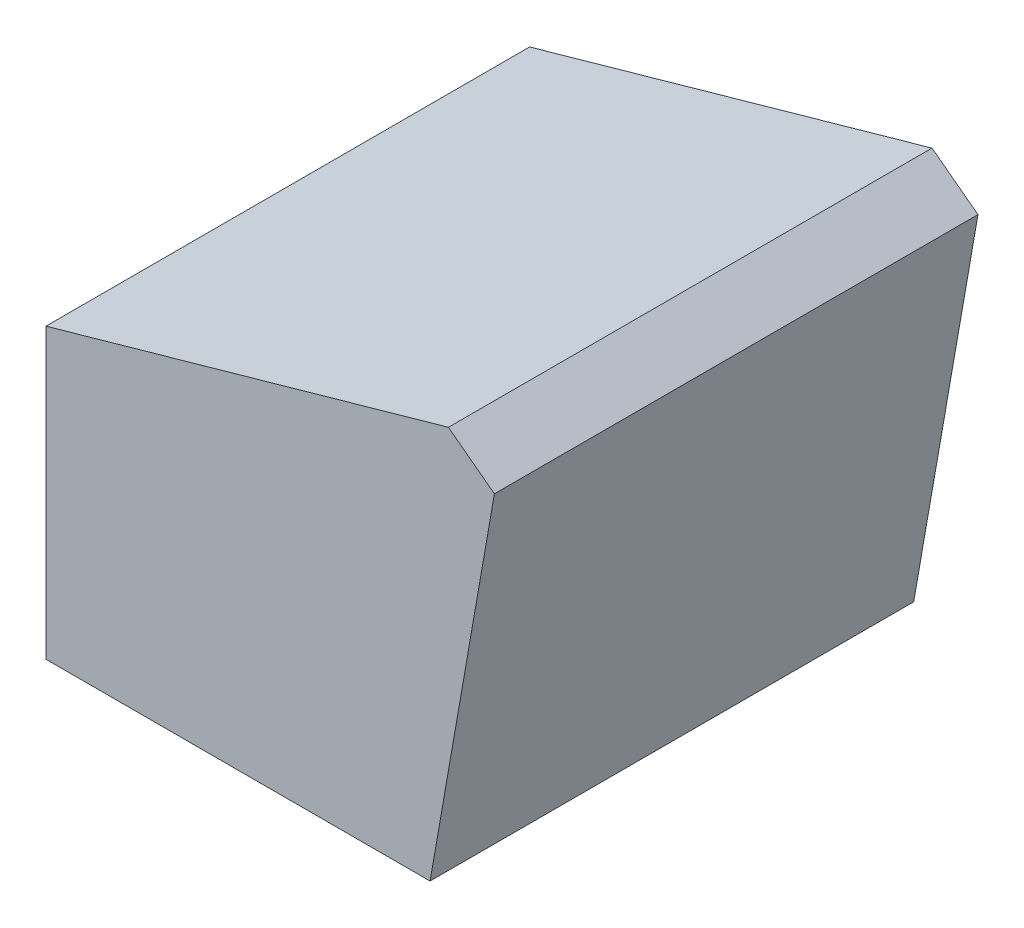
ISO-10303-21;
HEADER;
FILE_DESCRIPTION(('STEP AP214'),'2;1');
FILE_NAME('part.step','',(''),(''),'','','');
FILE_SCHEMA(('AUTOMOTIVE_DESIGN { 1 0 10303 214 1 1 1 1 }'));
ENDSEC;
DATA;
#1=APPLICATION_CONTEXT('core data for automotive mechanical design processes');
#2=APPLICATION_PROTOCOL_DEFINITION('international standard','automotive_design',2000,#1);
#3=PRODUCT_CONTEXT('',#1,'mechanical');
#4=PRODUCT('Part','Part','',(#3));
#5=PRODUCT_RELATED_PRODUCT_CATEGORY('part','',(#4));
#6=PRODUCT_DEFINITION_FORMATION('','',#4);
#7=PRODUCT_DEFINITION_CONTEXT('part definition',#1,'design');
#8=PRODUCT_DEFINITION('design','',#6,#7);
#9=PRODUCT_DEFINITION_SHAPE('','',#8);
#10=(LENGTH_UNIT() NAMED_UNIT(*) SI_UNIT(.MILLI.,.METRE.));
#11=(NAMED_UNIT(*) PLANE_ANGLE_UNIT() SI_UNIT($,.RADIAN.));
#12=(NAMED_UNIT(*) SI_UNIT($,.STERADIAN.) SOLID_ANGLE_UNIT());
#13=UNCERTAINTY_MEASURE_WITH_UNIT(LENGTH_MEASURE(1.E-05),#10,'distance_accuracy_value','');
#14=(GEOMETRIC_REPRESENTATION_CONTEXT(3) GLOBAL_UNCERTAINTY_ASSIGNED_CONTEXT((#13)) GLOBAL_UNIT_ASSIGNED_CONTEXT((#10,
#11,#12)) REPRESENTATION_CONTEXT('',''));
#15=CARTESIAN_POINT('',(0.,0.,0.));
#16=DIRECTION('',(0.,0.,1.));
#17=DIRECTION('',(1.,0.,0.));
#18=AXIS2_PLACEMENT_3D('',#15,#16,#17);
#19=CARTESIAN_POINT('',(26.7999269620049,43.1755735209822,25.));
#20=DIRECTION('',(-0.985028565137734,0.172391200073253,0.));
#21=DIRECTION('',(-0.172391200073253,-0.985028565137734,0.));
#22=AXIS2_PLACEMENT_3D('',#19,#20,#21);
#23=PLANE('',#22);
#24=DIRECTION('',(0.172391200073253,0.985028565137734,0.));
#25=VECTOR('',#24,1.);
#26=CARTESIAN_POINT('',(26.7999269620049,43.1755735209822,-25.));
#27=LINE('',#26,#25);
#28=CARTESIAN_POINT('',(19.2437106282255,0.,-25.));
#29=VERTEX_POINT('',#28);
#30=CARTESIAN_POINT('',(25.8942697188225,38.0007255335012,-25.));
#31=VERTEX_POINT('',#30);
#32=EDGE_CURVE('E112',#29,#31,#27,.T.);
#33=ORIENTED_EDGE('',*,*,#32,.T.);
#34=DIRECTION('',(0.,0.,1.));
#35=VECTOR('',#34,1.);
#36=CARTESIAN_POINT('',(25.8942697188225,38.0007255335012,25.));
#37=LINE('',#36,#35);
#38=CARTESIAN_POINT('',(25.8942697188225,38.0007255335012,25.));
#39=VERTEX_POINT('',#38);
#40=EDGE_CURVE('E44',#31,#39,#37,.T.);
#41=ORIENTED_EDGE('',*,*,#40,.T.);
#42=DIRECTION('',(0.172391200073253,0.985028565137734,0.));
#43=VECTOR('',#42,1.);
#44=CARTESIAN_POINT('',(26.7999269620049,43.1755735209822,25.));
#45=LINE('',#44,#43);
#46=CARTESIAN_POINT('',(19.2437106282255,0.,25.));
#47=VERTEX_POINT('',#46);
#48=EDGE_CURVE('E92',#47,#39,#45,.T.);
#49=ORIENTED_EDGE('',*,*,#48,.F.);
#50=DIRECTION('',(0.,0.,-1.));
#51=VECTOR('',#50,1.);
#52=CARTESIAN_POINT('',(19.2437106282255,0.,25.));
#53=LINE('',#52,#51);
#54=EDGE_CURVE('E108',#47,#29,#53,.T.);
#55=ORIENTED_EDGE('',*,*,#54,.T.);
#56=EDGE_LOOP('',(#33,#41,#49,#55));
#57=FACE_BOUND('',#56,.T.);
#58=ADVANCED_FACE('F36',(#57),#23,.F.);
#59=CARTESIAN_POINT('',(-20.4666177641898,29.8316170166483,25.));
#60=DIRECTION('',(0.27169340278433,-0.962383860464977,0.));
#61=DIRECTION('',(0.962383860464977,0.27169340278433,0.));
#62=AXIS2_PLACEMENT_3D('',#59,#60,#61);
#63=PLANE('',#62);
#64=DIRECTION('',(-0.962383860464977,-0.27169340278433,0.));
#65=VECTOR('',#64,1.);
#66=CARTESIAN_POINT('',(-20.4666177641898,29.8316170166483,25.));
#67=LINE('',#66,#65);
#68=CARTESIAN_POINT('',(21.1390752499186,41.5774419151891,25.));
#69=VERTEX_POINT('',#68);
#70=CARTESIAN_POINT('',(-20.4666177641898,29.8316170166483,25.));
#71=VERTEX_POINT('',#70);
#72=EDGE_CURVE('E82',#69,#71,#67,.T.);
#73=ORIENTED_EDGE('',*,*,#72,.F.);
#74=DIRECTION('',(0.,0.,-1.));
#75=VECTOR('',#74,1.);
#76=CARTESIAN_POINT('',(21.1390752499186,41.5774419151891,25.));
#77=LINE('',#76,#75);
#78=CARTESIAN_POINT('',(21.1390752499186,41.5774419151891,-25.));
#79=VERTEX_POINT('',#78);
#80=EDGE_CURVE('E100',#69,#79,#77,.T.);
#81=ORIENTED_EDGE('',*,*,#80,.T.);
#82=DIRECTION('',(-0.962383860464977,-0.27169340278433,0.));
#83=VECTOR('',#82,1.);
#84=CARTESIAN_POINT('',(-20.4666177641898,29.8316170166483,-25.));
#85=LINE('',#84,#83);
#86=CARTESIAN_POINT('',(-20.4666177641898,29.8316170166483,-25.));
#87=VERTEX_POINT('',#86);
#88=EDGE_CURVE('E97',#79,#87,#85,.T.);
#89=ORIENTED_EDGE('',*,*,#88,.T.);
#90=DIRECTION('',(0.,0.,-1.));
#91=VECTOR('',#90,1.);
#92=CARTESIAN_POINT('',(-20.4666177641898,29.8316170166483,25.));
#93=LINE('',#92,#91);
#94=EDGE_CURVE('E95',#71,#87,#93,.T.);
#95=ORIENTED_EDGE('',*,*,#94,.F.);
#96=EDGE_LOOP('',(#73,#81,#89,#95));
#97=FACE_BOUND('',#96,.T.);
#98=ADVANCED_FACE('F96',(#97),#63,.F.);
#99=CARTESIAN_POINT('',(-20.4666177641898,0.,25.));
#100=DIRECTION('',(1.,0.,0.));
#101=DIRECTION('',(0.,0.,-1.));
#102=AXIS2_PLACEMENT_3D('',#99,#100,#101);
#103=PLANE('',#102);
#104=DIRECTION('',(0.,-1.,0.));
#105=VECTOR('',#104,1.);
#106=CARTESIAN_POINT('',(-20.4666177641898,0.,-25.));
#107=LINE('',#106,#105);
#108=CARTESIAN_POINT('',(-20.4666177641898,0.,-25.));
#109=VERTEX_POINT('',#108);
#110=EDGE_CURVE('E115',#87,#109,#107,.T.);
#111=ORIENTED_EDGE('',*,*,#110,.T.);
#112=DIRECTION('',(0.,0.,-1.));
#113=VECTOR('',#112,1.);
#114=CARTESIAN_POINT('',(-20.4666177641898,0.,25.));
#115=LINE('',#114,#113);
#116=CARTESIAN_POINT('',(-20.4666177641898,0.,25.));
#117=VERTEX_POINT('',#116);
#118=EDGE_CURVE('E101',#117,#109,#115,.T.);
#119=ORIENTED_EDGE('',*,*,#118,.F.);
#120=DIRECTION('',(0.,-1.,0.));
#121=VECTOR('',#120,1.);
#122=CARTESIAN_POINT('',(-20.4666177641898,0.,25.));
#123=LINE('',#122,#121);
#124=EDGE_CURVE('E86',#71,#117,#123,.T.);
#125=ORIENTED_EDGE('',*,*,#124,.F.);
#126=ORIENTED_EDGE('',*,*,#94,.T.);
#127=EDGE_LOOP('',(#111,#119,#125,#126));
#128=FACE_BOUND('',#127,.T.);
#129=ADVANCED_FACE('F103',(#128),#103,.F.);
#130=CARTESIAN_POINT('',(19.2437106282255,0.,25.));
#131=DIRECTION('',(0.,1.,0.));
#132=DIRECTION('',(0.,0.,1.));
#133=AXIS2_PLACEMENT_3D('',#130,#131,#132);
#134=PLANE('',#133);
#135=DIRECTION('',(1.,0.,0.));
#136=VECTOR('',#135,1.);
#137=CARTESIAN_POINT('',(19.2437106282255,0.,-25.));
#138=LINE('',#137,#136);
#139=EDGE_CURVE('E117',#109,#29,#138,.T.);
#140=ORIENTED_EDGE('',*,*,#139,.T.);
#141=ORIENTED_EDGE('',*,*,#54,.F.);
#142=DIRECTION('',(1.,0.,0.));
#143=VECTOR('',#142,1.);
#144=CARTESIAN_POINT('',(19.2437106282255,0.,25.));
#145=LINE('',#144,#143);
#146=EDGE_CURVE('E106',#117,#47,#145,.T.);
#147=ORIENTED_EDGE('',*,*,#146,.F.);
#148=ORIENTED_EDGE('',*,*,#118,.T.);
#149=EDGE_LOOP('',(#140,#141,#147,#148));
#150=FACE_BOUND('',#149,.T.);
#151=ADVANCED_FACE('F127',(#150),#134,.F.);
#152=CARTESIAN_POINT('',(0.,0.,25.));
#153=DIRECTION('',(0.,0.,-1.));
#154=DIRECTION('',(-1.,0.,0.));
#155=AXIS2_PLACEMENT_3D('',#152,#153,#154);
#156=PLANE('',#155);
#157=ORIENTED_EDGE('',*,*,#48,.T.);
#158=DIRECTION('',(0.799166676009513,-0.601109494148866,0.));
#159=VECTOR('',#158,1.);
#160=CARTESIAN_POINT('',(21.1390752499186,41.5774419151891,25.));
#161=LINE('',#160,#159);
#162=EDGE_CURVE('E13',#39,#69,#161,.F.);
#163=ORIENTED_EDGE('',*,*,#162,.T.);
#164=ORIENTED_EDGE('',*,*,#72,.T.);
#165=ORIENTED_EDGE('',*,*,#124,.T.);
#166=ORIENTED_EDGE('',*,*,#146,.T.);
#167=EDGE_LOOP('',(#157,#163,#164,#165,#166));
#168=FACE_BOUND('',#167,.T.);
#169=ADVANCED_FACE('F84',(#168),#156,.F.);
#170=CARTESIAN_POINT('',(0.,0.,-25.));
#171=DIRECTION('',(0.,0.,-1.));
#172=DIRECTION('',(-1.,0.,0.));
#173=AXIS2_PLACEMENT_3D('',#170,#171,#172);
#174=PLANE('',#173);
#175=ORIENTED_EDGE('',*,*,#88,.F.);
#176=DIRECTION('',(-0.799166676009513,0.601109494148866,0.));
#177=VECTOR('',#176,1.);
#178=CARTESIAN_POINT('',(27.6114866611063,36.7090858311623,-25.));
#179=LINE('',#178,#177);
#180=EDGE_CURVE('E58',#79,#31,#179,.F.);
#181=ORIENTED_EDGE('',*,*,#180,.T.);
#182=ORIENTED_EDGE('',*,*,#32,.F.);
#183=ORIENTED_EDGE('',*,*,#139,.F.);
#184=ORIENTED_EDGE('',*,*,#110,.F.);
#185=EDGE_LOOP('',(#175,#181,#182,#183,#184));
#186=FACE_BOUND('',#185,.T.);
#187=ADVANCED_FACE('F124',(#186),#174,.T.);
#188=CARTESIAN_POINT('',(21.1390752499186,41.5774419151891,25.));
#189=DIRECTION('',(-0.601109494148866,-0.799166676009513,0.));
#190=DIRECTION('',(0.,0.,-1.));
#191=AXIS2_PLACEMENT_3D('',#188,#189,#190);
#192=PLANE('',#191);
#193=ORIENTED_EDGE('',*,*,#162,.F.);
#194=ORIENTED_EDGE('',*,*,#40,.F.);
#195=ORIENTED_EDGE('',*,*,#180,.F.);
#196=ORIENTED_EDGE('',*,*,#80,.F.);
#197=EDGE_LOOP('',(#193,#194,#195,#196));
#198=FACE_BOUND('',#197,.T.);
#199=ADVANCED_FACE('F38',(#198),#192,.F.);
#200=CLOSED_SHELL('',(#58,#98,#129,#151,#169,#187,#199));
#201=MANIFOLD_SOLID_BREP('B2',#200);
#202=ADVANCED_BREP_SHAPE_REPRESENTATION('',(#18,#201),#14);
#203=SHAPE_DEFINITION_REPRESENTATION(#9,#202);
ENDSEC;
END-ISO-10303-21;
